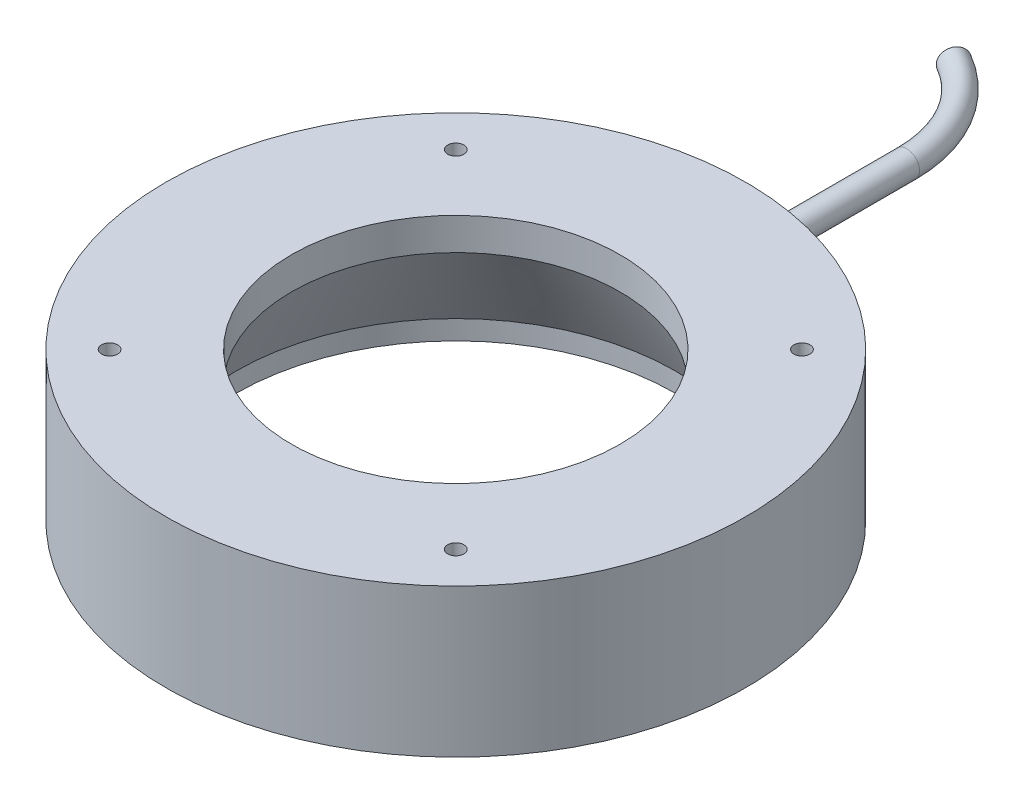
ISO-10303-21;
HEADER;
FILE_DESCRIPTION(('STEP AP214'),'2;1');
FILE_NAME('part.step','',(''),(''),'','','');
FILE_SCHEMA(('AUTOMOTIVE_DESIGN { 1 0 10303 214 1 1 1 1 }'));
ENDSEC;
DATA;
#1=APPLICATION_CONTEXT('core data for automotive mechanical design processes');
#2=APPLICATION_PROTOCOL_DEFINITION('international standard','automotive_design',2000,#1);
#3=PRODUCT_CONTEXT('',#1,'mechanical');
#4=PRODUCT('Part','Part','',(#3));
#5=PRODUCT_RELATED_PRODUCT_CATEGORY('part','',(#4));
#6=PRODUCT_DEFINITION_FORMATION('','',#4);
#7=PRODUCT_DEFINITION_CONTEXT('part definition',#1,'design');
#8=PRODUCT_DEFINITION('design','',#6,#7);
#9=PRODUCT_DEFINITION_SHAPE('','',#8);
#10=(LENGTH_UNIT() NAMED_UNIT(*) SI_UNIT(.MILLI.,.METRE.));
#11=(NAMED_UNIT(*) PLANE_ANGLE_UNIT() SI_UNIT($,.RADIAN.));
#12=(NAMED_UNIT(*) SI_UNIT($,.STERADIAN.) SOLID_ANGLE_UNIT());
#13=UNCERTAINTY_MEASURE_WITH_UNIT(LENGTH_MEASURE(1.E-05),#10,'distance_accuracy_value','');
#14=(GEOMETRIC_REPRESENTATION_CONTEXT(3) GLOBAL_UNCERTAINTY_ASSIGNED_CONTEXT((#13)) GLOBAL_UNIT_ASSIGNED_CONTEXT((#10,
#11,#12)) REPRESENTATION_CONTEXT('',''));
#15=CARTESIAN_POINT('',(0.,0.,0.));
#16=DIRECTION('',(0.,0.,1.));
#17=DIRECTION('',(1.,0.,0.));
#18=AXIS2_PLACEMENT_3D('',#15,#16,#17);
#19=CARTESIAN_POINT('',(0.,0.,0.));
#20=DIRECTION('',(0.,1.,0.));
#21=DIRECTION('',(-1.,0.,0.));
#22=AXIS2_PLACEMENT_3D('',#19,#20,#21);
#23=CYLINDRICAL_SURFACE('',#22,45.);
#24=CARTESIAN_POINT('',(0.,0.,0.));
#25=DIRECTION('',(0.,1.,0.));
#26=DIRECTION('',(-1.,0.,0.));
#27=AXIS2_PLACEMENT_3D('',#24,#25,#26);
#28=CIRCLE('',#27,45.);
#29=CARTESIAN_POINT('',(-45.,0.,0.));
#30=VERTEX_POINT('',#29);
#31=EDGE_CURVE('E47',#30,#30,#28,.T.);
#32=ORIENTED_EDGE('',*,*,#31,.F.);
#33=EDGE_LOOP('',(#32));
#34=FACE_BOUND('',#33,.T.);
#35=CARTESIAN_POINT('',(0.,-23.,0.));
#36=DIRECTION('',(0.,1.,0.));
#37=DIRECTION('',(-1.,0.,0.));
#38=AXIS2_PLACEMENT_3D('',#35,#36,#37);
#39=CIRCLE('',#38,45.);
#40=CARTESIAN_POINT('',(-45.,-23.,0.));
#41=VERTEX_POINT('',#40);
#42=EDGE_CURVE('E104',#41,#41,#39,.T.);
#43=ORIENTED_EDGE('',*,*,#42,.T.);
#44=EDGE_LOOP('',(#43));
#45=FACE_BOUND('',#44,.T.);
#46=CARTESIAN_POINT('',(-2.,-10.,-44.955533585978));
#47=CARTESIAN_POINT('',(-1.9999950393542,-9.88771866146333,-44.9555341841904));
#48=CARTESIAN_POINT('',(-1.99051292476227,-9.7753573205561,-44.9559587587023));
#49=CARTESIAN_POINT('',(-1.95282075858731,-9.55373321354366,-44.9576115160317));
#50=CARTESIAN_POINT('',(-1.92458854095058,-9.44447427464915,-44.9588406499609));
#51=CARTESIAN_POINT('',(-1.85020512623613,-9.23229755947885,-44.9619630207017));
#52=CARTESIAN_POINT('',(-1.80406294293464,-9.12937662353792,-44.9638559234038));
#53=CARTESIAN_POINT('',(-1.69518295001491,-8.93276936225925,-44.968092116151));
#54=CARTESIAN_POINT('',(-1.63244910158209,-8.83908084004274,-44.9704352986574));
#55=CARTESIAN_POINT('',(-1.4921080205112,-8.66349192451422,-44.975310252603));
#56=CARTESIAN_POINT('',(-1.41449008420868,-8.58160008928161,-44.9778421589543));
#57=CARTESIAN_POINT('',(-1.24660501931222,-8.43200193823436,-44.9828079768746));
#58=CARTESIAN_POINT('',(-1.15633737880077,-8.36429619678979,-44.9852418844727));
#59=CARTESIAN_POINT('',(-0.965672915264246,-8.2449705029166,-44.9897383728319));
#60=CARTESIAN_POINT('',(-0.865272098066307,-8.19335692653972,-44.9918008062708));
#61=CARTESIAN_POINT('',(-0.657219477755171,-8.10772168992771,-44.9953206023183));
#62=CARTESIAN_POINT('',(-0.549567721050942,-8.07369991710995,-44.9967779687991));
#63=CARTESIAN_POINT('',(-0.330145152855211,-8.0242358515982,-44.9989225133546));
#64=CARTESIAN_POINT('',(-0.218377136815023,-8.00878118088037,-44.9996102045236));
#65=CARTESIAN_POINT('',(0.00616876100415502,-7.99685183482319,-45.0001396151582));
#66=CARTESIAN_POINT('',(0.118946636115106,-8.00037703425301,-44.9999813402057));
#67=CARTESIAN_POINT('',(0.342227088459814,-8.02629705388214,-44.9988370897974));
#68=CARTESIAN_POINT('',(0.452731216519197,-8.04867854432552,-44.9978516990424));
#69=CARTESIAN_POINT('',(0.668412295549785,-8.11165516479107,-44.995164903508));
#70=CARTESIAN_POINT('',(0.773589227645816,-8.15225035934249,-44.9934634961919));
#71=CARTESIAN_POINT('',(0.975673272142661,-8.25051727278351,-44.9895353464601));
#72=CARTESIAN_POINT('',(1.07257742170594,-8.30819507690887,-44.9873084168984));
#73=CARTESIAN_POINT('',(1.25533274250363,-8.43898548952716,-44.9825800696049));
#74=CARTESIAN_POINT('',(1.34118385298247,-8.51209818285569,-44.9800786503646));
#75=CARTESIAN_POINT('',(1.4994738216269,-8.67175835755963,-44.9750805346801));
#76=CARTESIAN_POINT('',(1.57190101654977,-8.75831740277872,-44.972583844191));
#77=CARTESIAN_POINT('',(1.70119738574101,-8.94237251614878,-44.9678788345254));
#78=CARTESIAN_POINT('',(1.7580665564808,-9.03986858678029,-44.9656705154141));
#79=CARTESIAN_POINT('',(1.85463147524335,-9.24303708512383,-44.9617914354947));
#80=CARTESIAN_POINT('',(1.8943268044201,-9.34870971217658,-44.9601206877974));
#81=CARTESIAN_POINT('',(1.95540953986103,-9.56522855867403,-44.9575056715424));
#82=CARTESIAN_POINT('',(1.97679705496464,-9.67607474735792,-44.9565613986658));
#83=CARTESIAN_POINT('',(2.00064266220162,-9.89969264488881,-44.9555066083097));
#84=CARTESIAN_POINT('',(2.00311693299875,-10.0124626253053,-44.955395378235));
#85=CARTESIAN_POINT('',(1.989108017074,-10.2368162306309,-44.9560173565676));
#86=CARTESIAN_POINT('',(1.97262487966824,-10.3483998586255,-44.9567505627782));
#87=CARTESIAN_POINT('',(1.92118245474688,-10.5671679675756,-44.958978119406));
#88=CARTESIAN_POINT('',(1.88623055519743,-10.6743541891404,-44.9604721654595));
#89=CARTESIAN_POINT('',(1.79885024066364,-10.8813384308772,-44.9640527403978));
#90=CARTESIAN_POINT('',(1.74642174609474,-10.9811364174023,-44.9661392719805));
#91=CARTESIAN_POINT('',(1.62553490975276,-11.1705857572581,-44.970671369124));
#92=CARTESIAN_POINT('',(1.55706569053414,-11.2602301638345,-44.9731171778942));
#93=CARTESIAN_POINT('',(1.40605691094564,-11.4267578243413,-44.9780912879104));
#94=CARTESIAN_POINT('',(1.32351727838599,-11.503641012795,-44.9806195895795));
#95=CARTESIAN_POINT('',(1.14664124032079,-11.6425180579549,-44.9854757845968));
#96=CARTESIAN_POINT('',(1.05229663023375,-11.7045014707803,-44.9878035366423));
#97=CARTESIAN_POINT('',(0.854530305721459,-11.8117480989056,-44.9919942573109));
#98=CARTESIAN_POINT('',(0.751108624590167,-11.8570113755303,-44.9938572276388));
#99=CARTESIAN_POINT('',(0.538162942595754,-11.9295145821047,-44.9969077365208));
#100=CARTESIAN_POINT('',(0.428641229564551,-11.9567612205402,-44.9980955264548));
#101=CARTESIAN_POINT('',(0.206572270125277,-11.9924796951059,-44.99966280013));
#102=CARTESIAN_POINT('',(0.0940250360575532,-12.0009516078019,-45.0000422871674));
#103=CARTESIAN_POINT('',(-0.13079634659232,-11.998879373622,-44.9999502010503));
#104=CARTESIAN_POINT('',(-0.243070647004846,-11.9883516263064,-44.9994793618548));
#105=CARTESIAN_POINT('',(-0.464256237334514,-11.9486127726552,-44.997741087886));
#106=CARTESIAN_POINT('',(-0.573167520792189,-11.9194016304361,-44.9964736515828));
#107=CARTESIAN_POINT('',(-0.784539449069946,-11.8431283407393,-44.9932848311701));
#108=CARTESIAN_POINT('',(-0.887000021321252,-11.7960659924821,-44.9913634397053));
#109=CARTESIAN_POINT('',(-1.08256572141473,-11.6854294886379,-44.9870829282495));
#110=CARTESIAN_POINT('',(-1.17567115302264,-11.6218558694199,-44.9847238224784));
#111=CARTESIAN_POINT('',(-1.34996459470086,-11.4799442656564,-44.9798312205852));
#112=CARTESIAN_POINT('',(-1.4311435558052,-11.4015951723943,-44.9772975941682));
#113=CARTESIAN_POINT('',(-1.57922042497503,-11.2323578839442,-44.9723422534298));
#114=CARTESIAN_POINT('',(-1.64611480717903,-11.1414666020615,-44.9699205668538));
#115=CARTESIAN_POINT('',(-1.76374839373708,-10.9496653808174,-44.965460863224));
#116=CARTESIAN_POINT('',(-1.81447370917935,-10.8487469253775,-44.9634231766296));
#117=CARTESIAN_POINT('',(-1.8982006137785,-10.6398931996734,-44.9599667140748));
#118=CARTESIAN_POINT('',(-1.93122320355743,-10.5319664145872,-44.9585472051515));
#119=CARTESIAN_POINT('',(-1.9699159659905,-10.3528044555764,-44.9568642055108));
#120=CARTESIAN_POINT('',(-1.98118314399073,-10.2827305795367,-44.9563674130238));
#121=CARTESIAN_POINT('',(-1.99622672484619,-10.1417817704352,-44.9557019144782));
#122=CARTESIAN_POINT('',(-2.00000313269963,-10.0709068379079,-44.9555332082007));
#123=CARTESIAN_POINT('',(-2.,-10.,-44.955533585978));
#124=B_SPLINE_CURVE_WITH_KNOTS('',3,(#46,#47,#48,#49,#50,#51,#52,#53,#54,#55,#56,#57,#58,#59,
#60,#61,#62,#63,#64,#65,#66,#67,#68,#69,#70,#71,#72,#73,#74,#75,#76,#77,#78,#79,#80,#81,#82,#83,
#84,#85,#86,#87,#88,#89,#90,#91,#92,#93,#94,#95,#96,#97,#98,#99,#100,#101,#102,#103,#104,#105,
#106,#107,#108,#109,#110,#111,#112,#113,#114,#115,#116,#117,#118,#119,#120,#121,#122,#123),
.UNSPECIFIED.,.T.,.F.,(4,2,2,2,2,2,2,2,2,2,2,2,2,2,2,2,2,2,2,2,2,2,2,2,2,2,2,2,2,2,2,2,2,2,2,2,
2,2,4),(0.,0.336585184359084,0.673568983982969,1.01038340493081,1.3471174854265,
1.68409463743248,2.02108543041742,2.35820957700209,2.69533156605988,3.03222868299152,
3.36912357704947,3.7057805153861,4.04243864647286,4.37921684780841,4.71599690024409,
5.05306820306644,5.39013958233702,5.72721918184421,6.06429677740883,6.40108599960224,
6.73787434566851,7.0745280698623,7.41118332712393,7.74806753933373,8.08495348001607,
8.42207487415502,8.75919503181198,9.09618959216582,9.43318277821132,9.76988522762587,
10.1065883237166,10.4432952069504,10.7799911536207,11.116941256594,11.4539744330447,
11.7912963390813,12.1282171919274,12.3407743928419,12.5533314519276),.UNSPECIFIED.);
#125=CARTESIAN_POINT('',(-2.,-10.,-44.955533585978));
#126=VERTEX_POINT('',#125);
#127=EDGE_CURVE('E77',#126,#126,#124,.T.);
#128=ORIENTED_EDGE('',*,*,#127,.F.);
#129=EDGE_LOOP('',(#128));
#130=FACE_BOUND('',#129,.T.);
#131=ADVANCED_FACE('F39',(#34,#45,#130),#23,.T.);
#132=CARTESIAN_POINT('',(0.,0.,0.));
#133=DIRECTION('',(0.,1.,0.));
#134=DIRECTION('',(-1.,0.,0.));
#135=AXIS2_PLACEMENT_3D('',#132,#133,#134);
#136=CYLINDRICAL_SURFACE('',#135,25.5);
#137=CARTESIAN_POINT('',(0.,0.,0.));
#138=DIRECTION('',(0.,1.,0.));
#139=DIRECTION('',(-1.,0.,0.));
#140=AXIS2_PLACEMENT_3D('',#137,#138,#139);
#141=CIRCLE('',#140,25.5);
#142=CARTESIAN_POINT('',(-25.5,0.,0.));
#143=VERTEX_POINT('',#142);
#144=EDGE_CURVE('E11',#143,#143,#141,.T.);
#145=ORIENTED_EDGE('',*,*,#144,.T.);
#146=EDGE_LOOP('',(#145));
#147=FACE_BOUND('',#146,.T.);
#148=CARTESIAN_POINT('',(0.,-5.00000000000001,0.));
#149=DIRECTION('',(0.,1.,0.));
#150=DIRECTION('',(-1.,0.,0.));
#151=AXIS2_PLACEMENT_3D('',#148,#149,#150);
#152=CIRCLE('',#151,25.5);
#153=CARTESIAN_POINT('',(-25.5,-5.,0.));
#154=VERTEX_POINT('',#153);
#155=EDGE_CURVE('E95',#154,#154,#152,.T.);
#156=ORIENTED_EDGE('',*,*,#155,.F.);
#157=EDGE_LOOP('',(#156));
#158=FACE_BOUND('',#157,.T.);
#159=ADVANCED_FACE('F41',(#147,#158),#136,.F.);
#160=CARTESIAN_POINT('',(-25.5,0.,0.));
#161=DIRECTION('',(0.,1.,0.));
#162=DIRECTION('',(-1.,0.,0.));
#163=AXIS2_PLACEMENT_3D('',#160,#161,#162);
#164=PLANE('',#163);
#165=CARTESIAN_POINT('',(-26.8700576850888,0.,-26.8700576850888));
#166=DIRECTION('',(0.,1.,0.));
#167=DIRECTION('',(0.,0.,1.));
#168=AXIS2_PLACEMENT_3D('',#165,#166,#167);
#169=CIRCLE('',#168,1.25);
#170=CARTESIAN_POINT('',(-26.8700576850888,0.,-25.6200576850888));
#171=VERTEX_POINT('',#170);
#172=EDGE_CURVE('E71',#171,#171,#169,.T.);
#173=ORIENTED_EDGE('',*,*,#172,.F.);
#174=EDGE_LOOP('',(#173));
#175=FACE_BOUND('',#174,.T.);
#176=CARTESIAN_POINT('',(-26.8700576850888,0.,26.8700576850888));
#177=DIRECTION('',(0.,1.,0.));
#178=DIRECTION('',(0.,0.,1.));
#179=AXIS2_PLACEMENT_3D('',#176,#177,#178);
#180=CIRCLE('',#179,1.25);
#181=CARTESIAN_POINT('',(-26.8700576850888,0.,28.1200576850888));
#182=VERTEX_POINT('',#181);
#183=EDGE_CURVE('E70',#182,#182,#180,.T.);
#184=ORIENTED_EDGE('',*,*,#183,.F.);
#185=EDGE_LOOP('',(#184));
#186=FACE_BOUND('',#185,.T.);
#187=CARTESIAN_POINT('',(26.8700576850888,0.,26.8700576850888));
#188=DIRECTION('',(0.,1.,0.));
#189=DIRECTION('',(0.,0.,1.));
#190=AXIS2_PLACEMENT_3D('',#187,#188,#189);
#191=CIRCLE('',#190,1.25);
#192=CARTESIAN_POINT('',(26.8700576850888,0.,28.1200576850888));
#193=VERTEX_POINT('',#192);
#194=EDGE_CURVE('E83',#193,#193,#191,.T.);
#195=ORIENTED_EDGE('',*,*,#194,.F.);
#196=EDGE_LOOP('',(#195));
#197=FACE_BOUND('',#196,.T.);
#198=CARTESIAN_POINT('',(26.8700576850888,0.,-26.8700576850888));
#199=DIRECTION('',(0.,1.,0.));
#200=DIRECTION('',(0.,0.,1.));
#201=AXIS2_PLACEMENT_3D('',#198,#199,#200);
#202=CIRCLE('',#201,1.25);
#203=CARTESIAN_POINT('',(26.8700576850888,0.,-25.6200576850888));
#204=VERTEX_POINT('',#203);
#205=EDGE_CURVE('E89',#204,#204,#202,.T.);
#206=ORIENTED_EDGE('',*,*,#205,.F.);
#207=EDGE_LOOP('',(#206));
#208=FACE_BOUND('',#207,.T.);
#209=ORIENTED_EDGE('',*,*,#31,.T.);
#210=EDGE_LOOP('',(#209));
#211=FACE_BOUND('',#210,.T.);
#212=ORIENTED_EDGE('',*,*,#144,.F.);
#213=EDGE_LOOP('',(#212));
#214=FACE_BOUND('',#213,.T.);
#215=ADVANCED_FACE('F109',(#175,#186,#197,#208,#211,#214),#164,.T.);
#216=CARTESIAN_POINT('',(-45.,-23.,0.));
#217=DIRECTION('',(0.,-1.,0.));
#218=DIRECTION('',(1.,0.,0.));
#219=AXIS2_PLACEMENT_3D('',#216,#217,#218);
#220=PLANE('',#219);
#221=CARTESIAN_POINT('',(0.,-23.,0.));
#222=DIRECTION('',(0.,1.,0.));
#223=DIRECTION('',(-1.,0.,0.));
#224=AXIS2_PLACEMENT_3D('',#221,#222,#223);
#225=CIRCLE('',#224,34.1602540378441);
#226=CARTESIAN_POINT('',(-34.1602540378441,-23.,0.));
#227=VERTEX_POINT('',#226);
#228=EDGE_CURVE('E101',#227,#227,#225,.T.);
#229=ORIENTED_EDGE('',*,*,#228,.T.);
#230=EDGE_LOOP('',(#229));
#231=FACE_BOUND('',#230,.T.);
#232=ORIENTED_EDGE('',*,*,#42,.F.);
#233=EDGE_LOOP('',(#232));
#234=FACE_BOUND('',#233,.T.);
#235=ADVANCED_FACE('F185',(#231,#234),#220,.T.);
#236=CARTESIAN_POINT('',(0.,0.,0.));
#237=DIRECTION('',(0.,1.,0.));
#238=DIRECTION('',(-1.,0.,0.));
#239=AXIS2_PLACEMENT_3D('',#236,#237,#238);
#240=CYLINDRICAL_SURFACE('',#239,34.1602540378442);
#241=CARTESIAN_POINT('',(0.,-20.,0.));
#242=DIRECTION('',(0.,1.,0.));
#243=DIRECTION('',(-1.,0.,0.));
#244=AXIS2_PLACEMENT_3D('',#241,#242,#243);
#245=CIRCLE('',#244,34.1602540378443);
#246=CARTESIAN_POINT('',(-34.1602540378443,-20.,0.));
#247=VERTEX_POINT('',#246);
#248=EDGE_CURVE('E98',#247,#247,#245,.T.);
#249=ORIENTED_EDGE('',*,*,#248,.T.);
#250=EDGE_LOOP('',(#249));
#251=FACE_BOUND('',#250,.T.);
#252=ORIENTED_EDGE('',*,*,#228,.F.);
#253=EDGE_LOOP('',(#252));
#254=FACE_BOUND('',#253,.T.);
#255=ADVANCED_FACE('F181',(#251,#254),#240,.F.);
#256=CARTESIAN_POINT('',(0.,-20.,0.));
#257=DIRECTION('',(0.,-1.,0.));
#258=DIRECTION('',(1.,0.,0.));
#259=AXIS2_PLACEMENT_3D('',#256,#257,#258);
#260=CONICAL_SURFACE('',#259,34.1602540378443,0.523598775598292);
#261=ORIENTED_EDGE('',*,*,#155,.T.);
#262=EDGE_LOOP('',(#261));
#263=FACE_BOUND('',#262,.T.);
#264=ORIENTED_EDGE('',*,*,#248,.F.);
#265=EDGE_LOOP('',(#264));
#266=FACE_BOUND('',#265,.T.);
#267=ADVANCED_FACE('F178',(#263,#266),#260,.F.);
#268=CARTESIAN_POINT('',(26.8700576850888,-8.50000000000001,-26.8700576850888));
#269=DIRECTION('',(0.,1.,0.));
#270=DIRECTION('',(0.,0.,1.));
#271=AXIS2_PLACEMENT_3D('',#268,#269,#270);
#272=CONICAL_SURFACE('',#271,1.25,1.02974425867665);
#273=CARTESIAN_POINT('',(26.8700576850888,-9.25107577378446,-26.8700576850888));
#274=VERTEX_POINT('',#273);
#275=VERTEX_LOOP('',#274);
#276=FACE_BOUND('',#275,.T.);
#277=CARTESIAN_POINT('',(26.8700576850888,-8.50000000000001,-26.8700576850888));
#278=DIRECTION('',(0.,1.,0.));
#279=DIRECTION('',(0.,0.,1.));
#280=AXIS2_PLACEMENT_3D('',#277,#278,#279);
#281=CIRCLE('',#280,1.25);
#282=CARTESIAN_POINT('',(26.8700576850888,-8.50000000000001,-25.6200576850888));
#283=VERTEX_POINT('',#282);
#284=EDGE_CURVE('E92',#283,#283,#281,.T.);
#285=ORIENTED_EDGE('',*,*,#284,.T.);
#286=EDGE_LOOP('',(#285));
#287=FACE_BOUND('',#286,.T.);
#288=ADVANCED_FACE('F174',(#276,#287),#272,.F.);
#289=CARTESIAN_POINT('',(26.8700576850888,0.,-26.8700576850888));
#290=DIRECTION('',(0.,1.,0.));
#291=DIRECTION('',(0.,0.,1.));
#292=AXIS2_PLACEMENT_3D('',#289,#290,#291);
#293=CYLINDRICAL_SURFACE('',#292,1.25);
#294=ORIENTED_EDGE('',*,*,#284,.F.);
#295=EDGE_LOOP('',(#294));
#296=FACE_BOUND('',#295,.T.);
#297=ORIENTED_EDGE('',*,*,#205,.T.);
#298=EDGE_LOOP('',(#297));
#299=FACE_BOUND('',#298,.T.);
#300=ADVANCED_FACE('F171',(#296,#299),#293,.F.);
#301=CARTESIAN_POINT('',(26.8700576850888,-8.50000000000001,26.8700576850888));
#302=DIRECTION('',(0.,1.,0.));
#303=DIRECTION('',(0.,0.,1.));
#304=AXIS2_PLACEMENT_3D('',#301,#302,#303);
#305=CONICAL_SURFACE('',#304,1.25,1.02974425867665);
#306=CARTESIAN_POINT('',(26.8700576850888,-9.25107577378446,26.8700576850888));
#307=VERTEX_POINT('',#306);
#308=VERTEX_LOOP('',#307);
#309=FACE_BOUND('',#308,.T.);
#310=CARTESIAN_POINT('',(26.8700576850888,-8.50000000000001,26.8700576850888));
#311=DIRECTION('',(0.,1.,0.));
#312=DIRECTION('',(0.,0.,1.));
#313=AXIS2_PLACEMENT_3D('',#310,#311,#312);
#314=CIRCLE('',#313,1.25);
#315=CARTESIAN_POINT('',(26.8700576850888,-8.50000000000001,28.1200576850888));
#316=VERTEX_POINT('',#315);
#317=EDGE_CURVE('E86',#316,#316,#314,.T.);
#318=ORIENTED_EDGE('',*,*,#317,.T.);
#319=EDGE_LOOP('',(#318));
#320=FACE_BOUND('',#319,.T.);
#321=ADVANCED_FACE('F167',(#309,#320),#305,.F.);
#322=CARTESIAN_POINT('',(26.8700576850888,0.,26.8700576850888));
#323=DIRECTION('',(0.,1.,0.));
#324=DIRECTION('',(0.,0.,1.));
#325=AXIS2_PLACEMENT_3D('',#322,#323,#324);
#326=CYLINDRICAL_SURFACE('',#325,1.25);
#327=ORIENTED_EDGE('',*,*,#317,.F.);
#328=EDGE_LOOP('',(#327));
#329=FACE_BOUND('',#328,.T.);
#330=ORIENTED_EDGE('',*,*,#194,.T.);
#331=EDGE_LOOP('',(#330));
#332=FACE_BOUND('',#331,.T.);
#333=ADVANCED_FACE('F163',(#329,#332),#326,.F.);
#334=CARTESIAN_POINT('',(-26.8700576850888,-8.49999999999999,26.8700576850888));
#335=DIRECTION('',(0.,1.,0.));
#336=DIRECTION('',(0.,0.,1.));
#337=AXIS2_PLACEMENT_3D('',#334,#335,#336);
#338=CONICAL_SURFACE('',#337,1.25,1.02974425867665);
#339=CARTESIAN_POINT('',(-26.8700576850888,-9.25107577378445,26.8700576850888));
#340=VERTEX_POINT('',#339);
#341=VERTEX_LOOP('',#340);
#342=FACE_BOUND('',#341,.T.);
#343=CARTESIAN_POINT('',(-26.8700576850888,-8.49999999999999,26.8700576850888));
#344=DIRECTION('',(0.,1.,0.));
#345=DIRECTION('',(0.,0.,1.));
#346=AXIS2_PLACEMENT_3D('',#343,#344,#345);
#347=CIRCLE('',#346,1.25);
#348=CARTESIAN_POINT('',(-26.8700576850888,-8.49999999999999,28.1200576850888));
#349=VERTEX_POINT('',#348);
#350=EDGE_CURVE('E74',#349,#349,#347,.T.);
#351=ORIENTED_EDGE('',*,*,#350,.T.);
#352=EDGE_LOOP('',(#351));
#353=FACE_BOUND('',#352,.T.);
#354=ADVANCED_FACE('F159',(#342,#353),#338,.F.);
#355=CARTESIAN_POINT('',(-26.8700576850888,0.,26.8700576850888));
#356=DIRECTION('',(0.,1.,0.));
#357=DIRECTION('',(0.,0.,1.));
#358=AXIS2_PLACEMENT_3D('',#355,#356,#357);
#359=CYLINDRICAL_SURFACE('',#358,1.25);
#360=ORIENTED_EDGE('',*,*,#350,.F.);
#361=EDGE_LOOP('',(#360));
#362=FACE_BOUND('',#361,.T.);
#363=ORIENTED_EDGE('',*,*,#183,.T.);
#364=EDGE_LOOP('',(#363));
#365=FACE_BOUND('',#364,.T.);
#366=ADVANCED_FACE('F64',(#362,#365),#359,.F.);
#367=CARTESIAN_POINT('',(-26.8700576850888,-8.49999999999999,-26.8700576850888));
#368=DIRECTION('',(0.,1.,0.));
#369=DIRECTION('',(0.,0.,1.));
#370=AXIS2_PLACEMENT_3D('',#367,#368,#369);
#371=CONICAL_SURFACE('',#370,1.25,1.02974425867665);
#372=CARTESIAN_POINT('',(-26.8700576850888,-9.25107577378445,-26.8700576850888));
#373=VERTEX_POINT('',#372);
#374=VERTEX_LOOP('',#373);
#375=FACE_BOUND('',#374,.T.);
#376=CARTESIAN_POINT('',(-26.8700576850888,-8.49999999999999,-26.8700576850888));
#377=DIRECTION('',(0.,1.,0.));
#378=DIRECTION('',(0.,0.,1.));
#379=AXIS2_PLACEMENT_3D('',#376,#377,#378);
#380=CIRCLE('',#379,1.25);
#381=CARTESIAN_POINT('',(-26.8700576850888,-8.49999999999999,-25.6200576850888));
#382=VERTEX_POINT('',#381);
#383=EDGE_CURVE('E68',#382,#382,#380,.T.);
#384=ORIENTED_EDGE('',*,*,#383,.T.);
#385=EDGE_LOOP('',(#384));
#386=FACE_BOUND('',#385,.T.);
#387=ADVANCED_FACE('F60',(#375,#386),#371,.F.);
#388=CARTESIAN_POINT('',(-26.8700576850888,0.,-26.8700576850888));
#389=DIRECTION('',(0.,1.,0.));
#390=DIRECTION('',(0.,0.,1.));
#391=AXIS2_PLACEMENT_3D('',#388,#389,#390);
#392=CYLINDRICAL_SURFACE('',#391,1.25);
#393=ORIENTED_EDGE('',*,*,#383,.F.);
#394=EDGE_LOOP('',(#393));
#395=FACE_BOUND('',#394,.T.);
#396=ORIENTED_EDGE('',*,*,#172,.T.);
#397=EDGE_LOOP('',(#396));
#398=FACE_BOUND('',#397,.T.);
#399=ADVANCED_FACE('F63',(#395,#398),#392,.F.);
#400=CARTESIAN_POINT('',(0.,-10.,500000.));
#401=DIRECTION('',(0.,0.,-1.));
#402=DIRECTION('',(-1.,0.,0.));
#403=AXIS2_PLACEMENT_3D('',#400,#401,#402);
#404=CYLINDRICAL_SURFACE('',#403,2.);
#405=ORIENTED_EDGE('',*,*,#127,.T.);
#406=EDGE_LOOP('',(#405));
#407=FACE_BOUND('',#406,.T.);
#408=CARTESIAN_POINT('',(0.,-10.,-70.));
#409=DIRECTION('',(0.,0.,-1.));
#410=DIRECTION('',(-1.,0.,0.));
#411=AXIS2_PLACEMENT_3D('',#408,#409,#410);
#412=CIRCLE('',#411,2.);
#413=CARTESIAN_POINT('',(2.,-10.,-70.));
#414=VERTEX_POINT('',#413);
#415=EDGE_CURVE('E122',#414,#414,#412,.T.);
#416=ORIENTED_EDGE('',*,*,#415,.F.);
#417=EDGE_LOOP('',(#416));
#418=FACE_BOUND('',#417,.T.);
#419=ADVANCED_FACE('F130',(#407,#418),#404,.T.);
#420=CARTESIAN_POINT('',(-20.,-10.,-70.));
#421=DIRECTION('',(0.,-1.,0.));
#422=DIRECTION('',(0.,0.,-1.));
#423=AXIS2_PLACEMENT_3D('',#420,#421,#422);
#424=TOROIDAL_SURFACE('',#423,20.,2.);
#425=CARTESIAN_POINT('',(-10.,-10.,-87.3205080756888));
#426=DIRECTION('',(-0.866025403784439,0.,-0.5));
#427=DIRECTION('',(-0.5,0.,0.866025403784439));
#428=AXIS2_PLACEMENT_3D('',#425,#426,#427);
#429=CIRCLE('',#428,2.);
#430=CARTESIAN_POINT('',(-9.,-10.,-89.0525588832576));
#431=VERTEX_POINT('',#430);
#432=EDGE_CURVE('E120',#431,#431,#429,.T.);
#433=CARTESIAN_POINT('',(-20.,-10.,-70.));
#434=DIRECTION('',(0.,-1.,0.));
#435=DIRECTION('',(0.,0.,-1.));
#436=AXIS2_PLACEMENT_3D('',#433,#434,#435);
#437=CIRCLE('',#436,22.);
#438=EDGE_CURVE('',#431,#414,#437,.T.);
#439=ORIENTED_EDGE('',*,*,#432,.F.);
#440=ORIENTED_EDGE('',*,*,#415,.T.);
#441=ORIENTED_EDGE('',*,*,#438,.T.);
#442=ORIENTED_EDGE('',*,*,#438,.F.);
#443=EDGE_LOOP('',(#439,#441,#440,#442));
#444=FACE_BOUND('',#443,.T.);
#445=ADVANCED_FACE('F135',(#444),#424,.T.);
#446=CARTESIAN_POINT('',(-10.,-10.,-87.3205080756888));
#447=DIRECTION('',(-0.866025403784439,0.,-0.5));
#448=DIRECTION('',(-0.5,0.,0.866025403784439));
#449=AXIS2_PLACEMENT_3D('',#446,#447,#448);
#450=PLANE('',#449);
#451=ORIENTED_EDGE('',*,*,#432,.T.);
#452=EDGE_LOOP('',(#451));
#453=FACE_BOUND('',#452,.T.);
#454=ADVANCED_FACE('F138',(#453),#450,.T.);
#455=CLOSED_SHELL('',(#131,#159,#215,#235,#255,#267,#288,#300,#321,#333,#354,#366,#387,#399,
#419,#445,#454));
#456=MANIFOLD_SOLID_BREP('B2',#455);
#457=ADVANCED_BREP_SHAPE_REPRESENTATION('',(#18,#456),#14);
#458=SHAPE_DEFINITION_REPRESENTATION(#9,#457);
ENDSEC;
END-ISO-10303-21;
